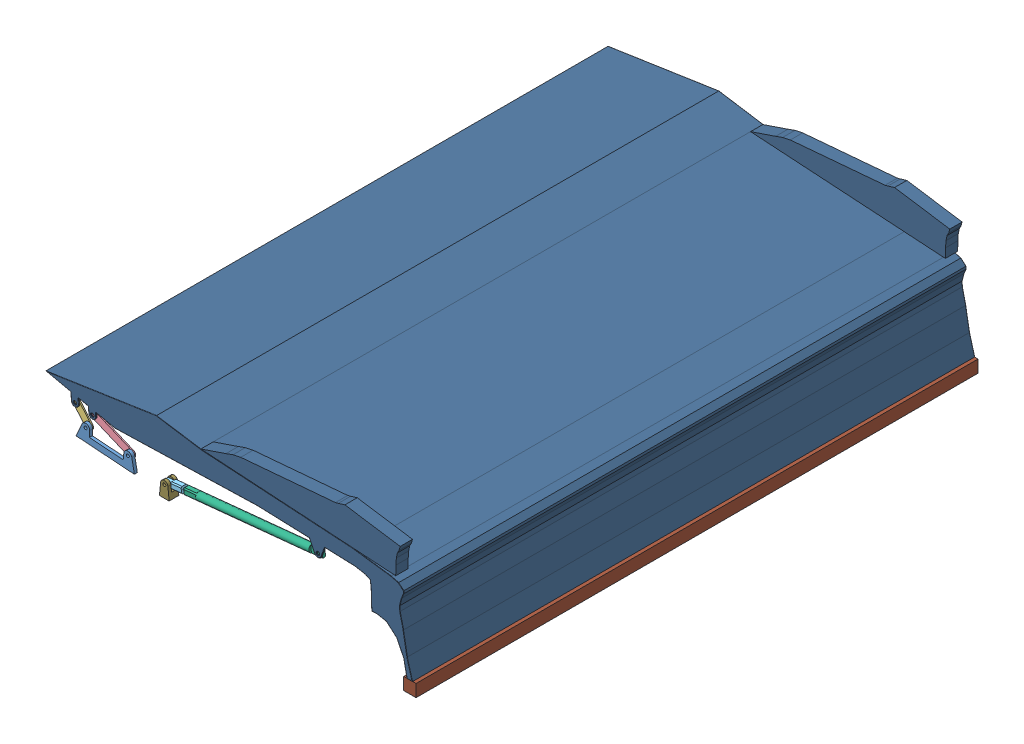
SolidWorks assembly HATCHBACK.SLDASM, configuration Fully_Closed_Postion (file format 11000). Lengths in mm.
Overall size (764.54 313.22 1169.03).
14 component instances, 12 part files, 17 mates.
Components (placement in the parent):
- Ground-1: Ground.SLDPRT [Default] at (61.136 -85.3614 583.4028) x (0.997454 -0.07131 0) z (0 0 1)
- Ground1-1: Ground1.SLDPRT [Default] at (61.136 -85.3614 576.5972) x (0.997454 -0.07131 0) z (0 0 1)
- Right_Shortarm-1: Right_Shortarm.SLDPRT [Default] at (80.9275 -61.3197 577.3068) x (-0.646418 0.762983 0) z (0 0 -1)
- Left_LongArm-1: Left_LongArm.SLDPRT [Default] at (167.9787 -67.5432 574.7668) x (-0.921562 0.38823 0) z (0 0 1)
- Left_Piston-1: Left_Piston.SLDPRT [0.49 in Piston dia] at (237.5103 -81.5811 574.1318) x (0.099635 -0.995024 0) z (0.995024 0.099635 0) size (12.7 12.7 287.02)
- Left_Cylinder-1: Left_Cylinder.SLDPRT [0.49 in Bore Hole] at (280.6577 -77.2606 574.1318) x (0 0 1) z (0.995024 0.099635 0) size (15.24 15.24 283.21)
- Right_LongArm-1: Right_LongArm.SLDPRT [Default] at (167.9787 -67.5432 585.2332) x (-0.921562 0.38823 0) z (0 0 1)
- Right_Piston-1: Right_Piston.SLDPRT [0.49 in Piston Dia] at (-917.2057 -195.3438 -574.8957) x (-0.098054 0.995181 0) z (-0.995181 -0.098054 0) size (12.7 12.7 287.02)
- Right_Cylinder-1: Right_Cylinder.SLDPRT [0.49 Bore Dia] at (-874.1008 -190.5956 -574.4382) x (0 0 -1) z (-0.995181 -0.098054 0) size (15.49 15.49 283.21)
- Lid1-1: Lid1.SLDPRT [Default] at (-2.6737 -4.8319 0) x (0.996917 0.078459 0) z (0 0 1)
- Fender-1: Fender.SLDPRT [Default] at (745.357 -206.7031 -0.1532) x (0 0 1) z (-1 0 0)
- Right_Shortarm-2: Right_Shortarm.SLDPRT [Default] at (55.3138 -31.0873 -577.6132) x (0.646418 -0.762983 0) z (0 0 1)
- Part1^HATCHBACK-1: Part1^HATCHBACK.sldprt [Default] at (251.6125 -10.9684 564.1318) x (0 -1 0) z (0 0 1)
- Part1^HATCHBACK-2: Part1^HATCHBACK.sldprt [Default] at (251.6125 -10.9684 -584.8957) x (0 -1 0) z (0 0 1)
Mates (geometry in assembly coordinates):
- Hinge17: hinge: cylinder of assembly; plane of assembly; cylinder of assembly; plane of assembly; cylinder of Part1^HATCHBACK-2 through (243.8287 -80.9484 -564.8957) axis (0 0 -1) radius 3.175; cylinder of Right_Piston-1 through (243.8287 -80.9484 -568.5457) axis (0 0 -1) radius 3.175; plane of Right_Piston-1 through (253.3171 -73.6328 -578.7057) normal (0 0 -1); plane of Part1^HATCHBACK-2 through (233.8287 -93.1984 -578.7057) normal (0 0 1)
- Hinge15: hinge: cylinder of assembly; plane of assembly; cylinder of assembly; plane of assembly; cylinder of Lid1-1 through (556.1401 -49.6756 -577.6132) axis (0 0 -1) radius 3.175; cylinder of Right_Cylinder-1 through (556.1401 -49.6756 -566.0562) axis (0 0 -1) radius 3.175; plane of Right_Cylinder-1 through (538.8877 -42.9529 -577.6132) normal (0 0 -1); plane of Lid1-1 through (556.1401 -49.6756 -577.6132) normal (0 0 1)
- Concentric61: concentric: cylinder of assembly; cylinder of assembly; cylinder of Right_Piston-1 through (523.0972 -52.9313 -574.4382) axis (-0.995181 -0.098054 0) radius 5.08; cylinder of Right_Cylinder-1 through (555.1965 -49.7686 -574.4382) axis (-0.995181 -0.098054 0) radius 6.223
- Hinge13: hinge: cylinder of assembly; plane of assembly; cylinder of assembly; plane of assembly; cylinder of Ground1-1 through (167.9787 -67.5432 -577.6132) axis (0 0 -1) radius 3.175; cylinder of Right_LongArm-1 through (167.9787 -67.5432 -577.6132) axis (0 0 1) radius 3.175; plane of Right_LongArm-1 through (167.9787 -67.5432 -577.6132) normal (0 0 -1); plane of Ground1-1 through (167.9787 -67.5432 -577.6132) normal (0 0 1)
- Hinge12: hinge: cylinder of assembly; plane of assembly; cylinder of assembly; plane of assembly; cylinder of Lid1-1 through (91.2015 -35.1989 -577.6132) axis (0 0 -1) radius 3.175; cylinder of Right_LongArm-1 through (91.2015 -35.1989 -577.6132) axis (0 0 1) radius 3.175; plane of Right_LongArm-1 through (167.9787 -67.5432 -577.6132) normal (0 0 -1); plane of Lid1-1 through (91.2015 -35.1989 -577.6132) normal (0 0 1)
- Hinge10: hinge: cylinder of assembly; plane of assembly; cylinder of assembly; plane of assembly; cylinder of Lid1-1 through (55.3138 -31.0873 -577.6132) axis (0 0 -1) radius 3.175; cylinder of Right_Shortarm-2 through (55.3138 -31.0873 -575.0732) axis (0 0 -1) radius 3.175; plane of Right_Shortarm-2 through (55.3138 -31.0873 -577.6132) normal (0 0 -1); plane of Lid1-1 through (55.3138 -31.0873 -577.6132) normal (0 0 1)
- Hinge11: hinge: cylinder of assembly; plane of assembly; cylinder of assembly; plane of assembly; cylinder of Ground1-1 through (80.9275 -61.3197 -577.6132) axis (0 0 -1) radius 3.175; cylinder of Right_Shortarm-2 through (80.9275 -61.3197 -575.0732) axis (0 0 -1) radius 3.175; plane of Right_Shortarm-2 through (55.3138 -31.0873 -577.6132) normal (0 0 -1); plane of Ground1-1 through (167.9787 -67.5432 -577.6132) normal (0 0 1)
- Hinge8: hinge: cylinder of assembly; plane of assembly; cylinder of assembly; plane of assembly; cylinder of Part1^HATCHBACK-2 through (243.8287 -80.9484 -564.8957) axis (0 0 -1) radius 3.175; cylinder of Right_Piston-1 through (243.8287 -80.9484 -568.5457) axis (0 0 -1) radius 3.175; plane of Right_Piston-1 through (253.3171 -73.6328 -578.7057) normal (0 0 -1); plane of Part1^HATCHBACK-2 through (233.8287 -93.1984 -578.7057) normal (0 0 1)
- Parallel2: parallel: plane of assembly through (0 0 0) normal (0 1 0); plane of Part1^HATCHBACK-2 through (253.8287 -105.1984 -564.8957) normal (0 -1 0); plane of assembly
- Hinge2: hinge: cylinder of assembly; plane of assembly; cylinder of assembly; plane of assembly; cylinder of Lid1-1 through (55.3138 -31.0873 577.3068) axis (0 0 1) radius 3.175; cylinder of Right_Shortarm-1 through (55.3138 -31.0873 574.7668) axis (0 0 1) radius 3.175; plane of Right_Shortarm-1 through (80.9275 -61.3197 577.3068) normal (0 0 1); plane of Lid1-1 through (55.3138 -31.0873 577.3068) normal (0 0 -1)
- Hinge3: hinge: cylinder of assembly; plane of assembly; cylinder of assembly; plane of assembly; cylinder of Ground-1 through (167.9787 -67.5432 577.3068) axis (0 0 1) radius 3.175; cylinder of Left_LongArm-1 through (167.9787 -67.5432 577.3068) axis (0 0 -1) radius 3.175; plane of Ground-1 through (167.9787 -67.5432 577.3068) normal (0 0 -1); plane of Left_LongArm-1 through (167.9787 -67.5432 577.3068) normal (0 0 1)
- Hinge4: hinge: cylinder of assembly; plane of assembly; cylinder of assembly; plane of assembly; cylinder of Lid1-1 through (91.2015 -35.1989 577.3068) axis (0 0 1) radius 3.175; cylinder of Left_LongArm-1 through (91.2015 -35.1989 577.3068) axis (0 0 -1) radius 3.175; plane of Left_LongArm-1 through (167.9787 -67.5432 577.3068) normal (0 0 1); plane of Lid1-1 through (91.2015 -35.1989 577.3068) normal (0 0 -1)
- Hinge6: hinge: cylinder of Part1^HATCHBACK-1 through (243.8287 -80.9484 584.1318) axis (0 0 -1) radius 3.175; cylinder of Left_Piston-1 through (243.8287 -80.9484 580.4818) axis (0 0 -1) radius 3.175; plane of Part1^HATCHBACK-1 through (233.8287 -93.1984 577.9418) normal (0 0 -1); plane of Left_Piston-1 through (254.5708 -86.2546 577.9418) normal (0 0 1)
- Hinge1: hinge: cylinder of assembly; plane of assembly; cylinder of assembly; plane of assembly; cylinder of Ground-1 through (80.9275 -61.3197 577.3068) axis (0 0 1) radius 3.175; cylinder of Right_Shortarm-1 through (80.9275 -61.3197 574.7668) axis (0 0 1) radius 3.175; plane of Right_Shortarm-1 through (80.9275 -61.3197 577.3068) normal (0 0 1); plane of Ground-1 through (167.9787 -67.5432 577.3068) normal (0 0 -1); plane of assembly; plane of ?; plane of assembly
- Parallel1: parallel: plane of Part1^HATCHBACK-1 through (253.8287 -105.1984 584.1318) normal (0 -1 0); plane of assembly through (0 0 0) normal (0 1 0)
- Concentric57: concentric: cylinder of assembly; cylinder of assembly; cylinder of Left_Cylinder-1 through (533.3938 -51.9533 574.1318) axis (-0.995024 -0.099635 0) radius 6.223; cylinder of Left_Piston-1 through (523.1021 -52.9838 574.1318) axis (-0.995024 -0.099635 0) radius 5.08
- Hinge9: hinge: cylinder of assembly; plane of assembly; cylinder of assembly; plane of assembly; cylinder of Lid1-1 through (556.1401 -49.6756 577.3068) axis (0 0 1) radius 3.175; cylinder of Left_Cylinder-1 through (556.1401 -49.6756 566.5118) axis (0 0 1) radius 3.175; plane of Left_Cylinder-1 through (538.953 -43.7385 577.3068) normal (0 0 1); plane of Lid1-1 through (556.1401 -49.6756 577.3068) normal (0 0 -1)
